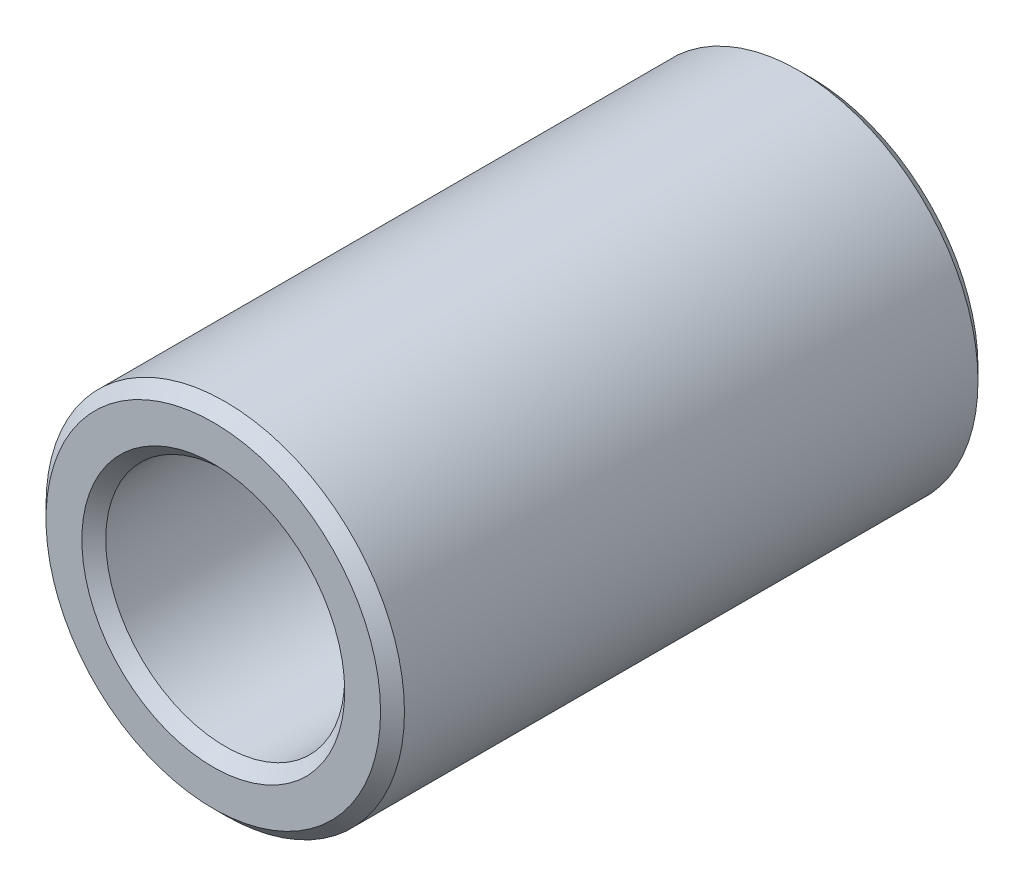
ISO-10303-21;
HEADER;
FILE_DESCRIPTION(('STEP AP214'),'2;1');
FILE_NAME('part.step','',(''),(''),'','','');
FILE_SCHEMA(('AUTOMOTIVE_DESIGN { 1 0 10303 214 1 1 1 1 }'));
ENDSEC;
DATA;
#1=APPLICATION_CONTEXT('core data for automotive mechanical design processes');
#2=APPLICATION_PROTOCOL_DEFINITION('international standard','automotive_design',2000,#1);
#3=PRODUCT_CONTEXT('',#1,'mechanical');
#4=PRODUCT('Part','Part','',(#3));
#5=PRODUCT_RELATED_PRODUCT_CATEGORY('part','',(#4));
#6=PRODUCT_DEFINITION_FORMATION('','',#4);
#7=PRODUCT_DEFINITION_CONTEXT('part definition',#1,'design');
#8=PRODUCT_DEFINITION('design','',#6,#7);
#9=PRODUCT_DEFINITION_SHAPE('','',#8);
#10=(LENGTH_UNIT() NAMED_UNIT(*) SI_UNIT(.MILLI.,.METRE.));
#11=(NAMED_UNIT(*) PLANE_ANGLE_UNIT() SI_UNIT($,.RADIAN.));
#12=(NAMED_UNIT(*) SI_UNIT($,.STERADIAN.) SOLID_ANGLE_UNIT());
#13=UNCERTAINTY_MEASURE_WITH_UNIT(LENGTH_MEASURE(1.E-05),#10,'distance_accuracy_value','');
#14=(GEOMETRIC_REPRESENTATION_CONTEXT(3) GLOBAL_UNCERTAINTY_ASSIGNED_CONTEXT((#13)) GLOBAL_UNIT_ASSIGNED_CONTEXT((#10,
#11,#12)) REPRESENTATION_CONTEXT('',''));
#15=CARTESIAN_POINT('',(0.,0.,0.));
#16=DIRECTION('',(0.,0.,1.));
#17=DIRECTION('',(1.,0.,0.));
#18=AXIS2_PLACEMENT_3D('',#15,#16,#17);
#19=CARTESIAN_POINT('',(0.,0.,25.));
#20=DIRECTION('',(0.,0.,1.));
#21=DIRECTION('',(1.,0.,0.));
#22=AXIS2_PLACEMENT_3D('',#19,#20,#21);
#23=PLANE('',#22);
#24=CARTESIAN_POINT('',(0.,0.,25.));
#25=DIRECTION('',(0.,0.,1.));
#26=DIRECTION('',(1.,0.,0.));
#27=AXIS2_PLACEMENT_3D('',#24,#25,#26);
#28=CIRCLE('',#27,5.5);
#29=CARTESIAN_POINT('',(5.5,0.,25.));
#30=VERTEX_POINT('',#29);
#31=EDGE_CURVE('E43',#30,#30,#28,.F.);
#32=ORIENTED_EDGE('',*,*,#31,.T.);
#33=EDGE_LOOP('',(#32));
#34=FACE_BOUND('',#33,.T.);
#35=CARTESIAN_POINT('',(0.,0.,25.));
#36=DIRECTION('',(0.,0.,1.));
#37=DIRECTION('',(1.,0.,0.));
#38=AXIS2_PLACEMENT_3D('',#35,#36,#37);
#39=CIRCLE('',#38,7.);
#40=CARTESIAN_POINT('',(7.,0.,25.));
#41=VERTEX_POINT('',#40);
#42=EDGE_CURVE('E47',#41,#41,#39,.T.);
#43=ORIENTED_EDGE('',*,*,#42,.T.);
#44=EDGE_LOOP('',(#43));
#45=FACE_BOUND('',#44,.T.);
#46=ADVANCED_FACE('F32',(#34,#45),#23,.T.);
#47=CARTESIAN_POINT('',(0.,0.,0.));
#48=DIRECTION('',(0.,0.,1.));
#49=DIRECTION('',(1.,0.,0.));
#50=AXIS2_PLACEMENT_3D('',#47,#48,#49);
#51=PLANE('',#50);
#52=CARTESIAN_POINT('',(0.,0.,0.));
#53=DIRECTION('',(0.,0.,1.));
#54=DIRECTION('',(1.,0.,0.));
#55=AXIS2_PLACEMENT_3D('',#52,#53,#54);
#56=CIRCLE('',#55,5.5);
#57=CARTESIAN_POINT('',(5.5,0.,0.));
#58=VERTEX_POINT('',#57);
#59=EDGE_CURVE('E58',#58,#58,#56,.T.);
#60=ORIENTED_EDGE('',*,*,#59,.T.);
#61=EDGE_LOOP('',(#60));
#62=FACE_BOUND('',#61,.T.);
#63=CARTESIAN_POINT('',(0.,0.,0.));
#64=DIRECTION('',(0.,0.,1.));
#65=DIRECTION('',(1.,0.,0.));
#66=AXIS2_PLACEMENT_3D('',#63,#64,#65);
#67=CIRCLE('',#66,7.);
#68=CARTESIAN_POINT('',(7.,0.,0.));
#69=VERTEX_POINT('',#68);
#70=EDGE_CURVE('E61',#69,#69,#67,.F.);
#71=ORIENTED_EDGE('',*,*,#70,.T.);
#72=EDGE_LOOP('',(#71));
#73=FACE_BOUND('',#72,.T.);
#74=ADVANCED_FACE('F65',(#62,#73),#51,.F.);
#75=CARTESIAN_POINT('',(0.,0.,25.));
#76=DIRECTION('',(0.,0.,-1.));
#77=DIRECTION('',(-1.,0.,0.));
#78=AXIS2_PLACEMENT_3D('',#75,#76,#77);
#79=CYLINDRICAL_SURFACE('',#78,7.5);
#80=CARTESIAN_POINT('',(0.,0.,24.5));
#81=DIRECTION('',(0.,0.,1.));
#82=DIRECTION('',(1.,0.,0.));
#83=AXIS2_PLACEMENT_3D('',#80,#81,#82);
#84=CIRCLE('',#83,7.5);
#85=CARTESIAN_POINT('',(7.5,0.,24.5));
#86=VERTEX_POINT('',#85);
#87=EDGE_CURVE('E10',#86,#86,#84,.F.);
#88=ORIENTED_EDGE('',*,*,#87,.T.);
#89=EDGE_LOOP('',(#88));
#90=FACE_BOUND('',#89,.T.);
#91=CARTESIAN_POINT('',(0.,0.,0.5));
#92=DIRECTION('',(0.,0.,1.));
#93=DIRECTION('',(1.,0.,0.));
#94=AXIS2_PLACEMENT_3D('',#91,#92,#93);
#95=CIRCLE('',#94,7.5);
#96=CARTESIAN_POINT('',(7.5,0.,0.5));
#97=VERTEX_POINT('',#96);
#98=EDGE_CURVE('E39',#97,#97,#95,.T.);
#99=ORIENTED_EDGE('',*,*,#98,.T.);
#100=EDGE_LOOP('',(#99));
#101=FACE_BOUND('',#100,.T.);
#102=ADVANCED_FACE('F81',(#90,#101),#79,.T.);
#103=CARTESIAN_POINT('',(0.,0.,25.));
#104=DIRECTION('',(0.,0.,-1.));
#105=DIRECTION('',(-1.,0.,0.));
#106=AXIS2_PLACEMENT_3D('',#103,#104,#105);
#107=CYLINDRICAL_SURFACE('',#106,5.);
#108=CARTESIAN_POINT('',(0.,0.,0.5));
#109=DIRECTION('',(0.,0.,1.));
#110=DIRECTION('',(1.,0.,0.));
#111=AXIS2_PLACEMENT_3D('',#108,#109,#110);
#112=CIRCLE('',#111,5.);
#113=CARTESIAN_POINT('',(5.,0.,0.5));
#114=VERTEX_POINT('',#113);
#115=EDGE_CURVE('E52',#114,#114,#112,.F.);
#116=ORIENTED_EDGE('',*,*,#115,.T.);
#117=EDGE_LOOP('',(#116));
#118=FACE_BOUND('',#117,.T.);
#119=CARTESIAN_POINT('',(0.,0.,24.5));
#120=DIRECTION('',(0.,0.,1.));
#121=DIRECTION('',(1.,0.,0.));
#122=AXIS2_PLACEMENT_3D('',#119,#120,#121);
#123=CIRCLE('',#122,5.);
#124=CARTESIAN_POINT('',(5.,0.,24.5));
#125=VERTEX_POINT('',#124);
#126=EDGE_CURVE('E55',#125,#125,#123,.T.);
#127=ORIENTED_EDGE('',*,*,#126,.T.);
#128=EDGE_LOOP('',(#127));
#129=FACE_BOUND('',#128,.T.);
#130=ADVANCED_FACE('F86',(#118,#129),#107,.F.);
#131=CARTESIAN_POINT('',(0.,0.,0.));
#132=DIRECTION('',(0.,0.,-1.));
#133=DIRECTION('',(-1.,0.,0.));
#134=AXIS2_PLACEMENT_3D('',#131,#132,#133);
#135=CONICAL_SURFACE('',#134,5.5,0.785398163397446);
#136=ORIENTED_EDGE('',*,*,#115,.F.);
#137=EDGE_LOOP('',(#136));
#138=FACE_BOUND('',#137,.T.);
#139=ORIENTED_EDGE('',*,*,#59,.F.);
#140=EDGE_LOOP('',(#139));
#141=FACE_BOUND('',#140,.T.);
#142=ADVANCED_FACE('F90',(#138,#141),#135,.F.);
#143=CARTESIAN_POINT('',(0.,0.,24.5));
#144=DIRECTION('',(0.,0.,1.));
#145=DIRECTION('',(1.,0.,0.));
#146=AXIS2_PLACEMENT_3D('',#143,#144,#145);
#147=CONICAL_SURFACE('',#146,5.,0.785398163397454);
#148=ORIENTED_EDGE('',*,*,#31,.F.);
#149=EDGE_LOOP('',(#148));
#150=FACE_BOUND('',#149,.T.);
#151=ORIENTED_EDGE('',*,*,#126,.F.);
#152=EDGE_LOOP('',(#151));
#153=FACE_BOUND('',#152,.T.);
#154=ADVANCED_FACE('F73',(#150,#153),#147,.F.);
#155=CARTESIAN_POINT('',(0.,0.,25.));
#156=DIRECTION('',(0.,0.,-1.));
#157=DIRECTION('',(-1.,0.,0.));
#158=AXIS2_PLACEMENT_3D('',#155,#156,#157);
#159=CONICAL_SURFACE('',#158,7.,0.785398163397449);
#160=ORIENTED_EDGE('',*,*,#87,.F.);
#161=EDGE_LOOP('',(#160));
#162=FACE_BOUND('',#161,.T.);
#163=ORIENTED_EDGE('',*,*,#42,.F.);
#164=EDGE_LOOP('',(#163));
#165=FACE_BOUND('',#164,.T.);
#166=ADVANCED_FACE('F69',(#162,#165),#159,.T.);
#167=CARTESIAN_POINT('',(0.,0.,0.5));
#168=DIRECTION('',(0.,0.,1.));
#169=DIRECTION('',(1.,0.,0.));
#170=AXIS2_PLACEMENT_3D('',#167,#168,#169);
#171=CONICAL_SURFACE('',#170,7.5,0.785398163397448);
#172=ORIENTED_EDGE('',*,*,#70,.F.);
#173=EDGE_LOOP('',(#172));
#174=FACE_BOUND('',#173,.T.);
#175=ORIENTED_EDGE('',*,*,#98,.F.);
#176=EDGE_LOOP('',(#175));
#177=FACE_BOUND('',#176,.T.);
#178=ADVANCED_FACE('F34',(#174,#177),#171,.T.);
#179=CLOSED_SHELL('',(#46,#74,#102,#130,#142,#154,#166,#178));
#180=MANIFOLD_SOLID_BREP('B2',#179);
#181=ADVANCED_BREP_SHAPE_REPRESENTATION('',(#18,#180),#14);
#182=SHAPE_DEFINITION_REPRESENTATION(#9,#181);
ENDSEC;
END-ISO-10303-21;
